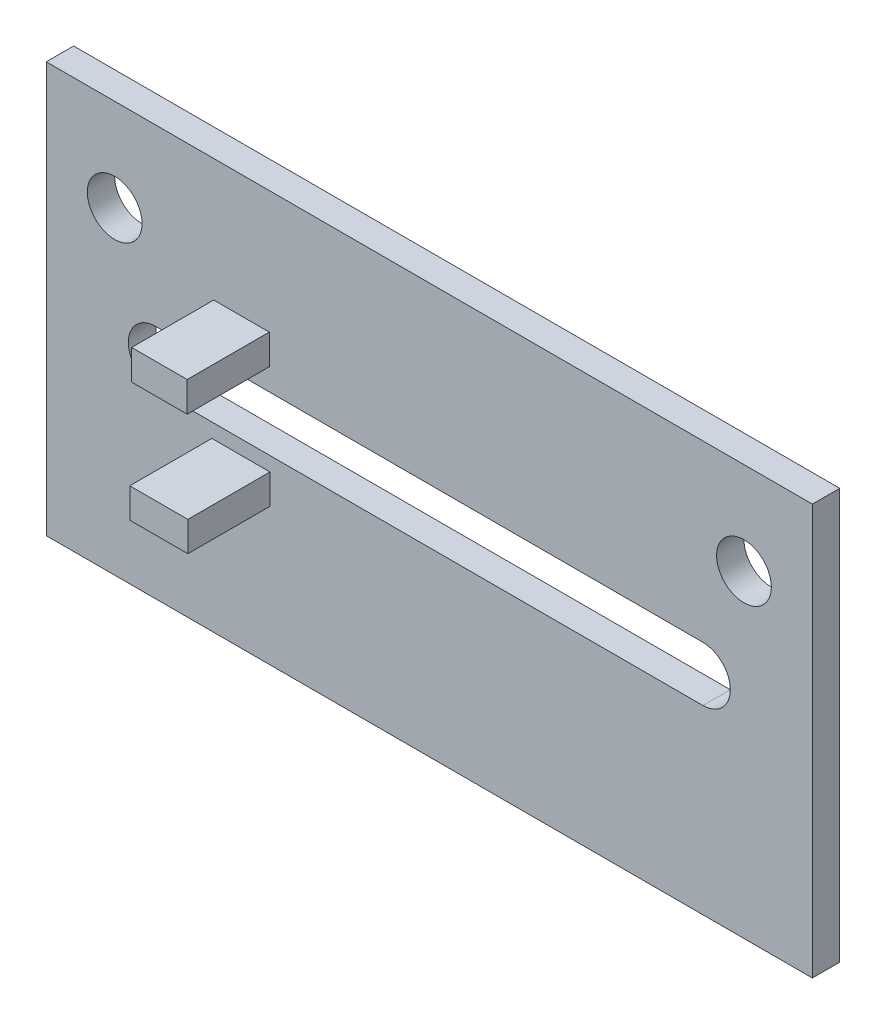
from build123d import *

# Parameters (mm, degrees)
ESQUISSE1_W        = 28
ESQUISSE1_H        = 15
ESQUISSE1_R        = 1
BOSS_EXTRU_1_DEPTH = 1
ESQUISSE2_W        = 2.123641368
ESQUISSE2_H        = 1.08750498
ESQUISSE2_W_2      = 2.030074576
ESQUISSE2_H_2      = 1.097936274
BOSS_EXTRU_2_DEPTH = 3


with BuildPart() as part:
    # Esquisse1 → Boss.-Extru.1 (new body)
    with BuildSketch(Plane.XY):
        with Locations((14, 7.5)):
            Rectangle(ESQUISSE1_W, ESQUISSE1_H)
        with Locations((2.5, 11.625394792)):
            Circle(ESQUISSE1_R, mode=Mode.SUBTRACT)
        with Locations((25.5, 11.625394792)):
            Circle(ESQUISSE1_R, mode=Mode.SUBTRACT)
        with BuildLine():
            Line((4, 8.625394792), (24, 8.625394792))
            ThreePointArc((24, 8.625394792), (25, 7.625394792), (24, 6.625394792))
            Line((24, 6.625394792), (4, 6.625394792))
            ThreePointArc((4, 6.625394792), (3, 7.625394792), (4, 8.625394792))
        make_face(mode=Mode.SUBTRACT)
    extrude(amount=BOSS_EXTRU_1_DEPTH)

    # Esquisse2 → Boss.-Extru.2 (add)
    with BuildSketch(Plane.XY.offset(1)):
        with Locations((7.113223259, 5.561080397)):
            Rectangle(ESQUISSE2_W, ESQUISSE2_H)
        with Locations((7.134671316, 9.969894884)):
            Rectangle(ESQUISSE2_W_2, ESQUISSE2_H_2)
    extrude(amount=BOSS_EXTRU_2_DEPTH)


solid = part.part
